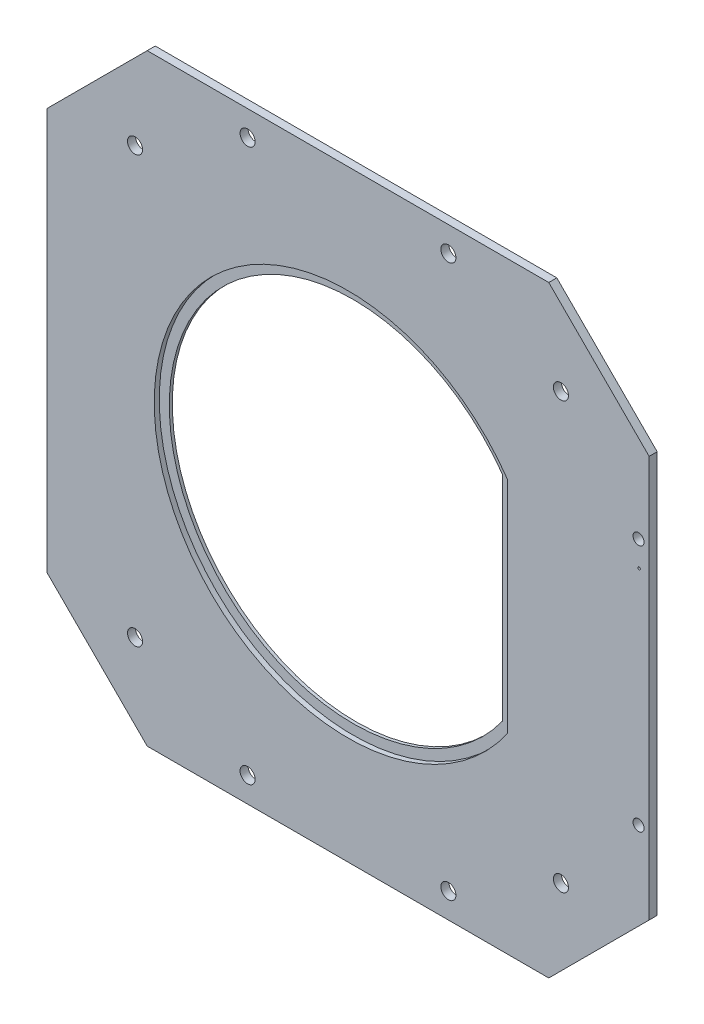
ISO-10303-21;
HEADER;
FILE_DESCRIPTION(('STEP AP214'),'2;1');
FILE_NAME('part.step','',(''),(''),'','','');
FILE_SCHEMA(('AUTOMOTIVE_DESIGN { 1 0 10303 214 1 1 1 1 }'));
ENDSEC;
DATA;
#1=APPLICATION_CONTEXT('core data for automotive mechanical design processes');
#2=APPLICATION_PROTOCOL_DEFINITION('international standard','automotive_design',2000,#1);
#3=PRODUCT_CONTEXT('',#1,'mechanical');
#4=PRODUCT('Part','Part','',(#3));
#5=PRODUCT_RELATED_PRODUCT_CATEGORY('part','',(#4));
#6=PRODUCT_DEFINITION_FORMATION('','',#4);
#7=PRODUCT_DEFINITION_CONTEXT('part definition',#1,'design');
#8=PRODUCT_DEFINITION('design','',#6,#7);
#9=PRODUCT_DEFINITION_SHAPE('','',#8);
#10=(LENGTH_UNIT() NAMED_UNIT(*) SI_UNIT(.MILLI.,.METRE.));
#11=(NAMED_UNIT(*) PLANE_ANGLE_UNIT() SI_UNIT($,.RADIAN.));
#12=(NAMED_UNIT(*) SI_UNIT($,.STERADIAN.) SOLID_ANGLE_UNIT());
#13=UNCERTAINTY_MEASURE_WITH_UNIT(LENGTH_MEASURE(1.E-05),#10,'distance_accuracy_value','');
#14=(GEOMETRIC_REPRESENTATION_CONTEXT(3) GLOBAL_UNCERTAINTY_ASSIGNED_CONTEXT((#13)) GLOBAL_UNIT_ASSIGNED_CONTEXT((#10,
#11,#12)) REPRESENTATION_CONTEXT('',''));
#15=CARTESIAN_POINT('',(0.,0.,0.));
#16=DIRECTION('',(0.,0.,1.));
#17=DIRECTION('',(1.,0.,0.));
#18=AXIS2_PLACEMENT_3D('',#15,#16,#17);
#19=CARTESIAN_POINT('',(0.,0.,0.));
#20=DIRECTION('',(0.,0.,1.));
#21=DIRECTION('',(1.,0.,0.));
#22=AXIS2_PLACEMENT_3D('',#19,#20,#21);
#23=CYLINDRICAL_SURFACE('',#22,36.6);
#24=CARTESIAN_POINT('',(0.,0.,0.6));
#25=DIRECTION('',(0.,0.,1.));
#26=DIRECTION('',(1.,0.,0.));
#27=AXIS2_PLACEMENT_3D('',#24,#25,#26);
#28=CIRCLE('',#27,36.6);
#29=CARTESIAN_POINT('',(29.75,-21.3189469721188,0.600000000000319));
#30=VERTEX_POINT('',#29);
#31=CARTESIAN_POINT('',(29.75,21.3189469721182,0.6));
#32=VERTEX_POINT('',#31);
#33=EDGE_CURVE('E59',#30,#32,#28,.F.);
#34=ORIENTED_EDGE('',*,*,#33,.F.);
#35=DIRECTION('',(0.,0.,1.));
#36=VECTOR('',#35,1.);
#37=CARTESIAN_POINT('',(29.75,-21.3189469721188,3.19189119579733E-13));
#38=LINE('',#37,#36);
#39=CARTESIAN_POINT('',(29.75,-21.3189469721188,3.19189119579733E-13));
#40=VERTEX_POINT('',#39);
#41=EDGE_CURVE('E160',#40,#30,#38,.T.);
#42=ORIENTED_EDGE('',*,*,#41,.F.);
#43=CARTESIAN_POINT('',(0.,0.,0.));
#44=DIRECTION('',(0.,0.,1.));
#45=DIRECTION('',(1.,0.,0.));
#46=AXIS2_PLACEMENT_3D('',#43,#44,#45);
#47=CIRCLE('',#46,36.6);
#48=CARTESIAN_POINT('',(29.75,21.3189469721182,0.));
#49=VERTEX_POINT('',#48);
#50=EDGE_CURVE('E154',#49,#40,#47,.T.);
#51=ORIENTED_EDGE('',*,*,#50,.F.);
#52=DIRECTION('',(0.,0.,1.));
#53=VECTOR('',#52,1.);
#54=CARTESIAN_POINT('',(29.75,21.3189469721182,0.));
#55=LINE('',#54,#53);
#56=EDGE_CURVE('E161',#49,#32,#55,.T.);
#57=ORIENTED_EDGE('',*,*,#56,.T.);
#58=EDGE_LOOP('',(#34,#42,#51,#57));
#59=FACE_BOUND('',#58,.T.);
#60=ADVANCED_FACE('F36',(#59),#23,.F.);
#61=CARTESIAN_POINT('',(29.75,21.3189469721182,0.));
#62=DIRECTION('',(1.,0.,0.));
#63=DIRECTION('',(0.,1.,0.));
#64=AXIS2_PLACEMENT_3D('',#61,#62,#63);
#65=PLANE('',#64);
#66=DIRECTION('',(0.,-1.,0.));
#67=VECTOR('',#66,1.);
#68=CARTESIAN_POINT('',(29.75,21.3189469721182,0.6));
#69=LINE('',#68,#67);
#70=EDGE_CURVE('E11',#32,#30,#69,.T.);
#71=ORIENTED_EDGE('',*,*,#70,.F.);
#72=ORIENTED_EDGE('',*,*,#56,.F.);
#73=DIRECTION('',(0.,1.,0.));
#74=VECTOR('',#73,1.);
#75=CARTESIAN_POINT('',(29.75,21.3189469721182,0.));
#76=LINE('',#75,#74);
#77=EDGE_CURVE('E157',#40,#49,#76,.T.);
#78=ORIENTED_EDGE('',*,*,#77,.F.);
#79=ORIENTED_EDGE('',*,*,#41,.T.);
#80=EDGE_LOOP('',(#71,#72,#78,#79));
#81=FACE_BOUND('',#80,.T.);
#82=ADVANCED_FACE('F333',(#81),#65,.F.);
#83=CARTESIAN_POINT('',(-59.9999999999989,40.0000000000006,1.59999999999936));
#84=DIRECTION('',(1.,0.,0.));
#85=DIRECTION('',(0.,1.,0.));
#86=AXIS2_PLACEMENT_3D('',#83,#84,#85);
#87=PLANE('',#86);
#88=DIRECTION('',(0.,-1.,0.));
#89=VECTOR('',#88,1.);
#90=CARTESIAN_POINT('',(-59.9999999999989,40.0000000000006,-5.30825383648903E-13));
#91=LINE('',#90,#89);
#92=CARTESIAN_POINT('',(-59.9999999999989,40.0000000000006,-5.30825383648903E-13));
#93=VERTEX_POINT('',#92);
#94=CARTESIAN_POINT('',(-59.9999999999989,-39.9999999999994,-3.19189119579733E-13));
#95=VERTEX_POINT('',#94);
#96=EDGE_CURVE('E164',#93,#95,#91,.T.);
#97=ORIENTED_EDGE('',*,*,#96,.T.);
#98=DIRECTION('',(0.,0.,-1.));
#99=VECTOR('',#98,1.);
#100=CARTESIAN_POINT('',(-59.9999999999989,-39.9999999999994,1.6));
#101=LINE('',#100,#99);
#102=CARTESIAN_POINT('',(-59.9999999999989,-39.9999999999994,1.6));
#103=VERTEX_POINT('',#102);
#104=EDGE_CURVE('E45',#103,#95,#101,.T.);
#105=ORIENTED_EDGE('',*,*,#104,.F.);
#106=DIRECTION('',(0.,-1.,0.));
#107=VECTOR('',#106,1.);
#108=CARTESIAN_POINT('',(-59.9999999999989,40.0000000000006,1.59999999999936));
#109=LINE('',#108,#107);
#110=CARTESIAN_POINT('',(-59.9999999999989,40.0000000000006,1.59999999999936));
#111=VERTEX_POINT('',#110);
#112=EDGE_CURVE('E183',#111,#103,#109,.T.);
#113=ORIENTED_EDGE('',*,*,#112,.F.);
#114=DIRECTION('',(0.,0.,-1.));
#115=VECTOR('',#114,1.);
#116=CARTESIAN_POINT('',(-59.9999999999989,40.0000000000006,1.59999999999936));
#117=LINE('',#116,#115);
#118=EDGE_CURVE('E200',#111,#93,#117,.T.);
#119=ORIENTED_EDGE('',*,*,#118,.T.);
#120=EDGE_LOOP('',(#97,#105,#113,#119));
#121=FACE_BOUND('',#120,.T.);
#122=ADVANCED_FACE('F38',(#121),#87,.F.);
#123=CARTESIAN_POINT('',(-59.9999999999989,-39.9999999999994,1.6));
#124=DIRECTION('',(0.707106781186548,0.707106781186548,0.));
#125=DIRECTION('',(-0.707106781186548,0.707106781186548,0.));
#126=AXIS2_PLACEMENT_3D('',#123,#124,#125);
#127=PLANE('',#126);
#128=DIRECTION('',(0.707106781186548,-0.707106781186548,0.));
#129=VECTOR('',#128,1.);
#130=CARTESIAN_POINT('',(-59.9999999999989,-39.9999999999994,-3.19189119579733E-13));
#131=LINE('',#130,#129);
#132=CARTESIAN_POINT('',(-39.9999999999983,-59.9999999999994,0.));
#133=VERTEX_POINT('',#132);
#134=EDGE_CURVE('E169',#95,#133,#131,.T.);
#135=ORIENTED_EDGE('',*,*,#134,.T.);
#136=DIRECTION('',(0.,0.,-1.));
#137=VECTOR('',#136,1.);
#138=CARTESIAN_POINT('',(-39.9999999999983,-59.9999999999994,1.59999999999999));
#139=LINE('',#138,#137);
#140=CARTESIAN_POINT('',(-39.9999999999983,-59.9999999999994,1.59999999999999));
#141=VERTEX_POINT('',#140);
#142=EDGE_CURVE('E218',#141,#133,#139,.T.);
#143=ORIENTED_EDGE('',*,*,#142,.F.);
#144=DIRECTION('',(0.707106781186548,-0.707106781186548,0.));
#145=VECTOR('',#144,1.);
#146=CARTESIAN_POINT('',(-59.9999999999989,-39.9999999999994,1.6));
#147=LINE('',#146,#145);
#148=EDGE_CURVE('E186',#103,#141,#147,.T.);
#149=ORIENTED_EDGE('',*,*,#148,.F.);
#150=ORIENTED_EDGE('',*,*,#104,.T.);
#151=EDGE_LOOP('',(#135,#143,#149,#150));
#152=FACE_BOUND('',#151,.T.);
#153=ADVANCED_FACE('F326',(#152),#127,.F.);
#154=CARTESIAN_POINT('',(-39.9999999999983,-59.9999999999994,1.59999999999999));
#155=DIRECTION('',(0.,1.,0.));
#156=DIRECTION('',(0.,0.,1.));
#157=AXIS2_PLACEMENT_3D('',#154,#155,#156);
#158=PLANE('',#157);
#159=DIRECTION('',(1.,0.,0.));
#160=VECTOR('',#159,1.);
#161=CARTESIAN_POINT('',(-39.9999999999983,-59.9999999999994,0.));
#162=LINE('',#161,#160);
#163=CARTESIAN_POINT('',(40.0000000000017,-60.,0.));
#164=VERTEX_POINT('',#163);
#165=EDGE_CURVE('E171',#133,#164,#162,.T.);
#166=ORIENTED_EDGE('',*,*,#165,.T.);
#167=DIRECTION('',(0.,0.,-1.));
#168=VECTOR('',#167,1.);
#169=CARTESIAN_POINT('',(40.0000000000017,-60.,1.60000000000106));
#170=LINE('',#169,#168);
#171=CARTESIAN_POINT('',(40.0000000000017,-60.,1.60000000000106));
#172=VERTEX_POINT('',#171);
#173=EDGE_CURVE('E215',#172,#164,#170,.T.);
#174=ORIENTED_EDGE('',*,*,#173,.F.);
#175=DIRECTION('',(1.,0.,0.));
#176=VECTOR('',#175,1.);
#177=CARTESIAN_POINT('',(-39.9999999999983,-59.9999999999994,1.59999999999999));
#178=LINE('',#177,#176);
#179=EDGE_CURVE('E188',#141,#172,#178,.T.);
#180=ORIENTED_EDGE('',*,*,#179,.F.);
#181=ORIENTED_EDGE('',*,*,#142,.T.);
#182=EDGE_LOOP('',(#166,#174,#180,#181));
#183=FACE_BOUND('',#182,.T.);
#184=ADVANCED_FACE('F322',(#183),#158,.F.);
#185=CARTESIAN_POINT('',(40.0000000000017,-60.,1.60000000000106));
#186=DIRECTION('',(-0.707106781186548,0.707106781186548,0.));
#187=DIRECTION('',(-0.707106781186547,-0.707106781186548,0.));
#188=AXIS2_PLACEMENT_3D('',#185,#186,#187);
#189=PLANE('',#188);
#190=DIRECTION('',(0.707106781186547,0.707106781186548,0.));
#191=VECTOR('',#190,1.);
#192=CARTESIAN_POINT('',(40.0000000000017,-60.,0.));
#193=LINE('',#192,#191);
#194=CARTESIAN_POINT('',(60.0000000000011,-40.,5.30825383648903E-13));
#195=VERTEX_POINT('',#194);
#196=EDGE_CURVE('E173',#164,#195,#193,.T.);
#197=ORIENTED_EDGE('',*,*,#196,.T.);
#198=DIRECTION('',(0.,0.,-1.));
#199=VECTOR('',#198,1.);
#200=CARTESIAN_POINT('',(60.0000000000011,-40.,1.60000000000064));
#201=LINE('',#200,#199);
#202=CARTESIAN_POINT('',(60.0000000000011,-40.,1.60000000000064));
#203=VERTEX_POINT('',#202);
#204=EDGE_CURVE('E212',#203,#195,#201,.T.);
#205=ORIENTED_EDGE('',*,*,#204,.F.);
#206=DIRECTION('',(0.707106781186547,0.707106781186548,0.));
#207=VECTOR('',#206,1.);
#208=CARTESIAN_POINT('',(40.0000000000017,-60.,1.60000000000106));
#209=LINE('',#208,#207);
#210=EDGE_CURVE('E190',#172,#203,#209,.T.);
#211=ORIENTED_EDGE('',*,*,#210,.F.);
#212=ORIENTED_EDGE('',*,*,#173,.T.);
#213=EDGE_LOOP('',(#197,#205,#211,#212));
#214=FACE_BOUND('',#213,.T.);
#215=ADVANCED_FACE('F319',(#214),#189,.F.);
#216=CARTESIAN_POINT('',(60.0000000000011,40.,1.6));
#217=DIRECTION('',(-1.,0.,0.));
#218=DIRECTION('',(0.,-1.,0.));
#219=AXIS2_PLACEMENT_3D('',#216,#217,#218);
#220=PLANE('',#219);
#221=DIRECTION('',(0.,1.,0.));
#222=VECTOR('',#221,1.);
#223=CARTESIAN_POINT('',(60.0000000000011,40.,3.19189119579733E-13));
#224=LINE('',#223,#222);
#225=CARTESIAN_POINT('',(60.0000000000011,40.,3.19189119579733E-13));
#226=VERTEX_POINT('',#225);
#227=EDGE_CURVE('E175',#195,#226,#224,.T.);
#228=ORIENTED_EDGE('',*,*,#227,.T.);
#229=DIRECTION('',(0.,0.,-1.));
#230=VECTOR('',#229,1.);
#231=CARTESIAN_POINT('',(60.0000000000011,40.,1.6));
#232=LINE('',#231,#230);
#233=CARTESIAN_POINT('',(60.0000000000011,40.,1.6));
#234=VERTEX_POINT('',#233);
#235=EDGE_CURVE('E209',#234,#226,#232,.T.);
#236=ORIENTED_EDGE('',*,*,#235,.F.);
#237=DIRECTION('',(0.,1.,0.));
#238=VECTOR('',#237,1.);
#239=CARTESIAN_POINT('',(60.0000000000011,40.,1.6));
#240=LINE('',#239,#238);
#241=EDGE_CURVE('E192',#203,#234,#240,.T.);
#242=ORIENTED_EDGE('',*,*,#241,.F.);
#243=ORIENTED_EDGE('',*,*,#204,.T.);
#244=EDGE_LOOP('',(#228,#236,#242,#243));
#245=FACE_BOUND('',#244,.T.);
#246=ADVANCED_FACE('F315',(#245),#220,.F.);
#247=CARTESIAN_POINT('',(40.0000000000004,60.,1.6));
#248=DIRECTION('',(-0.707106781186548,-0.707106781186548,0.));
#249=DIRECTION('',(0.707106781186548,-0.707106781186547,0.));
#250=AXIS2_PLACEMENT_3D('',#247,#248,#249);
#251=PLANE('',#250);
#252=DIRECTION('',(-0.707106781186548,0.707106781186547,0.));
#253=VECTOR('',#252,1.);
#254=CARTESIAN_POINT('',(40.0000000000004,60.,0.));
#255=LINE('',#254,#253);
#256=CARTESIAN_POINT('',(40.0000000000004,60.,0.));
#257=VERTEX_POINT('',#256);
#258=EDGE_CURVE('E177',#226,#257,#255,.T.);
#259=ORIENTED_EDGE('',*,*,#258,.T.);
#260=DIRECTION('',(0.,0.,-1.));
#261=VECTOR('',#260,1.);
#262=CARTESIAN_POINT('',(40.0000000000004,60.,1.6));
#263=LINE('',#262,#261);
#264=CARTESIAN_POINT('',(40.0000000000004,60.,1.6));
#265=VERTEX_POINT('',#264);
#266=EDGE_CURVE('E206',#265,#257,#263,.T.);
#267=ORIENTED_EDGE('',*,*,#266,.F.);
#268=DIRECTION('',(-0.707106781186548,0.707106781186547,0.));
#269=VECTOR('',#268,1.);
#270=CARTESIAN_POINT('',(40.0000000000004,60.,1.6));
#271=LINE('',#270,#269);
#272=EDGE_CURVE('E194',#234,#265,#271,.T.);
#273=ORIENTED_EDGE('',*,*,#272,.F.);
#274=ORIENTED_EDGE('',*,*,#235,.T.);
#275=EDGE_LOOP('',(#259,#267,#273,#274));
#276=FACE_BOUND('',#275,.T.);
#277=ADVANCED_FACE('F310',(#276),#251,.F.);
#278=CARTESIAN_POINT('',(-39.9999999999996,60.0000000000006,1.59999999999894));
#279=DIRECTION('',(0.,-1.,0.));
#280=DIRECTION('',(0.,0.,-1.));
#281=AXIS2_PLACEMENT_3D('',#278,#279,#280);
#282=PLANE('',#281);
#283=DIRECTION('',(-1.,0.,0.));
#284=VECTOR('',#283,1.);
#285=CARTESIAN_POINT('',(-39.9999999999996,60.0000000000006,0.));
#286=LINE('',#285,#284);
#287=CARTESIAN_POINT('',(-39.9999999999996,60.0000000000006,0.));
#288=VERTEX_POINT('',#287);
#289=EDGE_CURVE('E179',#257,#288,#286,.T.);
#290=ORIENTED_EDGE('',*,*,#289,.T.);
#291=DIRECTION('',(0.,0.,-1.));
#292=VECTOR('',#291,1.);
#293=CARTESIAN_POINT('',(-39.9999999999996,60.0000000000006,1.59999999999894));
#294=LINE('',#293,#292);
#295=CARTESIAN_POINT('',(-39.9999999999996,60.0000000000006,1.59999999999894));
#296=VERTEX_POINT('',#295);
#297=EDGE_CURVE('E203',#296,#288,#294,.T.);
#298=ORIENTED_EDGE('',*,*,#297,.F.);
#299=DIRECTION('',(-1.,0.,0.));
#300=VECTOR('',#299,1.);
#301=CARTESIAN_POINT('',(-39.9999999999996,60.0000000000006,1.59999999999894));
#302=LINE('',#301,#300);
#303=EDGE_CURVE('E196',#265,#296,#302,.T.);
#304=ORIENTED_EDGE('',*,*,#303,.F.);
#305=ORIENTED_EDGE('',*,*,#266,.T.);
#306=EDGE_LOOP('',(#290,#298,#304,#305));
#307=FACE_BOUND('',#306,.T.);
#308=ADVANCED_FACE('F304',(#307),#282,.F.);
#309=CARTESIAN_POINT('',(-59.9999999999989,40.0000000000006,1.59999999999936));
#310=DIRECTION('',(0.707106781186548,-0.707106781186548,0.));
#311=DIRECTION('',(0.707106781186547,0.707106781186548,0.));
#312=AXIS2_PLACEMENT_3D('',#309,#310,#311);
#313=PLANE('',#312);
#314=DIRECTION('',(-0.707106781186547,-0.707106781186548,0.));
#315=VECTOR('',#314,1.);
#316=CARTESIAN_POINT('',(-59.9999999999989,40.0000000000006,-5.30825383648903E-13));
#317=LINE('',#316,#315);
#318=EDGE_CURVE('E181',#288,#93,#317,.T.);
#319=ORIENTED_EDGE('',*,*,#318,.T.);
#320=ORIENTED_EDGE('',*,*,#118,.F.);
#321=DIRECTION('',(-0.707106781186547,-0.707106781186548,0.));
#322=VECTOR('',#321,1.);
#323=CARTESIAN_POINT('',(-59.9999999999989,40.0000000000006,1.59999999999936));
#324=LINE('',#323,#322);
#325=EDGE_CURVE('E198',#296,#111,#324,.T.);
#326=ORIENTED_EDGE('',*,*,#325,.F.);
#327=ORIENTED_EDGE('',*,*,#297,.T.);
#328=EDGE_LOOP('',(#319,#320,#326,#327));
#329=FACE_BOUND('',#328,.T.);
#330=ADVANCED_FACE('F272',(#329),#313,.F.);
#331=CARTESIAN_POINT('',(-59.9999999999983,-59.9999999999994,1.59999999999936));
#332=DIRECTION('',(0.,0.,1.));
#333=DIRECTION('',(1.,0.,0.));
#334=AXIS2_PLACEMENT_3D('',#331,#332,#333);
#335=PLANE('',#334);
#336=CARTESIAN_POINT('',(57.8900000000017,-24.6850000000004,1.6));
#337=DIRECTION('',(0.,0.,1.));
#338=DIRECTION('',(1.,0.,0.));
#339=AXIS2_PLACEMENT_3D('',#336,#337,#338);
#340=CIRCLE('',#339,1.09999999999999);
#341=CARTESIAN_POINT('',(58.9900000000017,-24.6850000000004,1.6));
#342=VERTEX_POINT('',#341);
#343=EDGE_CURVE('E554',#342,#342,#340,.T.);
#344=ORIENTED_EDGE('',*,*,#343,.F.);
#345=EDGE_LOOP('',(#344));
#346=FACE_BOUND('',#345,.T.);
#347=CARTESIAN_POINT('',(57.8900000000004,24.6849999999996,1.60000000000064));
#348=DIRECTION('',(0.,0.,1.));
#349=DIRECTION('',(1.,0.,0.));
#350=AXIS2_PLACEMENT_3D('',#347,#348,#349);
#351=CIRCLE('',#350,1.09999999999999);
#352=CARTESIAN_POINT('',(58.9900000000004,24.6849999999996,1.60000000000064));
#353=VERTEX_POINT('',#352);
#354=EDGE_CURVE('E556',#353,#353,#351,.T.);
#355=ORIENTED_EDGE('',*,*,#354,.F.);
#356=EDGE_LOOP('',(#355));
#357=FACE_BOUND('',#356,.T.);
#358=CARTESIAN_POINT('',(58.0000000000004,19.6849999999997,1.60000000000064));
#359=DIRECTION('',(0.,0.,1.));
#360=DIRECTION('',(1.,0.,0.));
#361=AXIS2_PLACEMENT_3D('',#358,#359,#360);
#362=CIRCLE('',#361,0.25);
#363=CARTESIAN_POINT('',(58.2500000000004,19.6849999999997,1.60000000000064));
#364=VERTEX_POINT('',#363);
#365=EDGE_CURVE('E564',#364,#364,#362,.T.);
#366=ORIENTED_EDGE('',*,*,#365,.F.);
#367=EDGE_LOOP('',(#366));
#368=FACE_BOUND('',#367,.T.);
#369=CARTESIAN_POINT('',(-42.426406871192,42.4264068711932,1.59999999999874));
#370=DIRECTION('',(0.,0.,1.));
#371=DIRECTION('',(1.,0.,0.));
#372=AXIS2_PLACEMENT_3D('',#369,#370,#371);
#373=CIRCLE('',#372,1.49999999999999);
#374=CARTESIAN_POINT('',(-40.926406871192,42.4264068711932,1.59999999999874));
#375=VERTEX_POINT('',#374);
#376=EDGE_CURVE('E254',#375,#375,#373,.T.);
#377=ORIENTED_EDGE('',*,*,#376,.F.);
#378=EDGE_LOOP('',(#377));
#379=FACE_BOUND('',#378,.T.);
#380=CARTESIAN_POINT('',(-20.0000000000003,55.0000000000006,1.6));
#381=DIRECTION('',(0.,0.,1.));
#382=DIRECTION('',(1.,0.,0.));
#383=AXIS2_PLACEMENT_3D('',#380,#381,#382);
#384=CIRCLE('',#383,1.49999999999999);
#385=CARTESIAN_POINT('',(-18.5000000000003,55.0000000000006,1.6));
#386=VERTEX_POINT('',#385);
#387=EDGE_CURVE('E244',#386,#386,#384,.T.);
#388=ORIENTED_EDGE('',*,*,#387,.F.);
#389=EDGE_LOOP('',(#388));
#390=FACE_BOUND('',#389,.T.);
#391=CARTESIAN_POINT('',(19.9999999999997,55.,1.6));
#392=DIRECTION('',(0.,0.,1.));
#393=DIRECTION('',(1.,0.,0.));
#394=AXIS2_PLACEMENT_3D('',#391,#392,#393);
#395=CIRCLE('',#394,1.49999999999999);
#396=CARTESIAN_POINT('',(21.4999999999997,55.,1.6));
#397=VERTEX_POINT('',#396);
#398=EDGE_CURVE('E241',#397,#397,#395,.T.);
#399=ORIENTED_EDGE('',*,*,#398,.F.);
#400=EDGE_LOOP('',(#399));
#401=FACE_BOUND('',#400,.T.);
#402=CARTESIAN_POINT('',(42.4264068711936,42.4264068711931,1.6));
#403=DIRECTION('',(0.,0.,1.));
#404=DIRECTION('',(1.,0.,0.));
#405=AXIS2_PLACEMENT_3D('',#402,#403,#404);
#406=CIRCLE('',#405,1.49999999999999);
#407=CARTESIAN_POINT('',(43.9264068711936,42.4264068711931,1.6));
#408=VERTEX_POINT('',#407);
#409=EDGE_CURVE('E238',#408,#408,#406,.T.);
#410=ORIENTED_EDGE('',*,*,#409,.F.);
#411=EDGE_LOOP('',(#410));
#412=FACE_BOUND('',#411,.T.);
#413=CARTESIAN_POINT('',(42.4264068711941,-42.4264068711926,1.60000000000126));
#414=DIRECTION('',(0.,0.,1.));
#415=DIRECTION('',(1.,0.,0.));
#416=AXIS2_PLACEMENT_3D('',#413,#414,#415);
#417=CIRCLE('',#416,1.49999999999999);
#418=CARTESIAN_POINT('',(43.9264068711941,-42.4264068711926,1.60000000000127));
#419=VERTEX_POINT('',#418);
#420=EDGE_CURVE('E234',#419,#419,#417,.T.);
#421=ORIENTED_EDGE('',*,*,#420,.F.);
#422=EDGE_LOOP('',(#421));
#423=FACE_BOUND('',#422,.T.);
#424=CARTESIAN_POINT('',(20.0000000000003,-55.,1.6));
#425=DIRECTION('',(0.,0.,1.));
#426=DIRECTION('',(1.,0.,0.));
#427=AXIS2_PLACEMENT_3D('',#424,#425,#426);
#428=CIRCLE('',#427,1.49999999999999);
#429=CARTESIAN_POINT('',(21.5000000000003,-55.,1.6));
#430=VERTEX_POINT('',#429);
#431=EDGE_CURVE('E230',#430,#430,#428,.T.);
#432=ORIENTED_EDGE('',*,*,#431,.F.);
#433=EDGE_LOOP('',(#432));
#434=FACE_BOUND('',#433,.T.);
#435=CARTESIAN_POINT('',(-19.9999999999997,-54.9999999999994,1.6));
#436=DIRECTION('',(0.,0.,1.));
#437=DIRECTION('',(1.,0.,0.));
#438=AXIS2_PLACEMENT_3D('',#435,#436,#437);
#439=CIRCLE('',#438,1.49999999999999);
#440=CARTESIAN_POINT('',(-18.4999999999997,-54.9999999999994,1.6));
#441=VERTEX_POINT('',#440);
#442=EDGE_CURVE('E226',#441,#441,#439,.T.);
#443=ORIENTED_EDGE('',*,*,#442,.F.);
#444=EDGE_LOOP('',(#443));
#445=FACE_BOUND('',#444,.T.);
#446=CARTESIAN_POINT('',(-42.4264068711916,-42.4264068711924,1.6));
#447=DIRECTION('',(0.,0.,1.));
#448=DIRECTION('',(1.,0.,0.));
#449=AXIS2_PLACEMENT_3D('',#446,#447,#448);
#450=CIRCLE('',#449,1.49999999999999);
#451=CARTESIAN_POINT('',(-40.9264068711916,-42.4264068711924,1.6));
#452=VERTEX_POINT('',#451);
#453=EDGE_CURVE('E144',#452,#452,#450,.T.);
#454=ORIENTED_EDGE('',*,*,#453,.F.);
#455=EDGE_LOOP('',(#454));
#456=FACE_BOUND('',#455,.T.);
#457=CARTESIAN_POINT('',(0.,0.,1.6));
#458=DIRECTION('',(0.,0.,1.));
#459=DIRECTION('',(1.,0.,0.));
#460=AXIS2_PLACEMENT_3D('',#457,#458,#459);
#461=CIRCLE('',#460,38.6);
#462=CARTESIAN_POINT('',(31.7500000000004,21.952163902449,1.60000000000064));
#463=VERTEX_POINT('',#462);
#464=CARTESIAN_POINT('',(31.7500000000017,-21.9521639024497,1.6));
#465=VERTEX_POINT('',#464);
#466=EDGE_CURVE('E53',#463,#465,#461,.T.);
#467=ORIENTED_EDGE('',*,*,#466,.F.);
#468=DIRECTION('',(0.,1.,0.));
#469=VECTOR('',#468,1.);
#470=CARTESIAN_POINT('',(31.7500000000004,21.952163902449,1.60000000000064));
#471=LINE('',#470,#469);
#472=EDGE_CURVE('E135',#465,#463,#471,.T.);
#473=ORIENTED_EDGE('',*,*,#472,.F.);
#474=EDGE_LOOP('',(#467,#473));
#475=FACE_BOUND('',#474,.T.);
#476=ORIENTED_EDGE('',*,*,#112,.T.);
#477=ORIENTED_EDGE('',*,*,#148,.T.);
#478=ORIENTED_EDGE('',*,*,#179,.T.);
#479=ORIENTED_EDGE('',*,*,#210,.T.);
#480=ORIENTED_EDGE('',*,*,#241,.T.);
#481=ORIENTED_EDGE('',*,*,#272,.T.);
#482=ORIENTED_EDGE('',*,*,#303,.T.);
#483=ORIENTED_EDGE('',*,*,#325,.T.);
#484=EDGE_LOOP('',(#476,#477,#478,#479,#480,#481,#482,#483));
#485=FACE_BOUND('',#484,.T.);
#486=ADVANCED_FACE('F139',(#346,#357,#368,#379,#390,#401,#412,#423,#434,#445,#456,#475,#485),
#335,.T.);
#487=CARTESIAN_POINT('',(-59.9999999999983,-59.9999999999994,0.));
#488=DIRECTION('',(0.,0.,1.));
#489=DIRECTION('',(1.,0.,0.));
#490=AXIS2_PLACEMENT_3D('',#487,#488,#489);
#491=PLANE('',#490);
#492=CARTESIAN_POINT('',(57.8900000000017,-24.6850000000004,6.34908792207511E-13));
#493=DIRECTION('',(0.,0.,1.));
#494=DIRECTION('',(1.,0.,0.));
#495=AXIS2_PLACEMENT_3D('',#492,#493,#494);
#496=CIRCLE('',#495,1.1);
#497=CARTESIAN_POINT('',(58.9900000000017,-24.6850000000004,6.3621728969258E-13));
#498=VERTEX_POINT('',#497);
#499=EDGE_CURVE('E551',#498,#498,#496,.T.);
#500=ORIENTED_EDGE('',*,*,#499,.T.);
#501=EDGE_LOOP('',(#500));
#502=FACE_BOUND('',#501,.T.);
#503=CARTESIAN_POINT('',(57.8900000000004,24.6849999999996,1.04083408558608E-13));
#504=DIRECTION('',(0.,0.,1.));
#505=DIRECTION('',(1.,0.,0.));
#506=AXIS2_PLACEMENT_3D('',#503,#504,#505);
#507=CIRCLE('',#506,1.1);
#508=CARTESIAN_POINT('',(58.9900000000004,24.6849999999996,1.05391906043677E-13));
#509=VERTEX_POINT('',#508);
#510=EDGE_CURVE('E561',#509,#509,#507,.T.);
#511=ORIENTED_EDGE('',*,*,#510,.T.);
#512=EDGE_LOOP('',(#511));
#513=FACE_BOUND('',#512,.T.);
#514=CARTESIAN_POINT('',(58.0000000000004,19.6849999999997,0.));
#515=DIRECTION('',(0.,0.,1.));
#516=DIRECTION('',(1.,0.,0.));
#517=AXIS2_PLACEMENT_3D('',#514,#515,#516);
#518=CIRCLE('',#517,0.25);
#519=CARTESIAN_POINT('',(58.2500000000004,19.6849999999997,0.));
#520=VERTEX_POINT('',#519);
#521=EDGE_CURVE('E566',#520,#520,#518,.T.);
#522=ORIENTED_EDGE('',*,*,#521,.T.);
#523=EDGE_LOOP('',(#522));
#524=FACE_BOUND('',#523,.T.);
#525=CARTESIAN_POINT('',(-42.426406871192,42.4264068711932,0.));
#526=DIRECTION('',(0.,0.,1.));
#527=DIRECTION('',(1.,0.,0.));
#528=AXIS2_PLACEMENT_3D('',#525,#526,#527);
#529=CIRCLE('',#528,1.49999999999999);
#530=CARTESIAN_POINT('',(-40.926406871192,42.4264068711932,0.));
#531=VERTEX_POINT('',#530);
#532=EDGE_CURVE('E40',#531,#531,#529,.T.);
#533=ORIENTED_EDGE('',*,*,#532,.T.);
#534=EDGE_LOOP('',(#533));
#535=FACE_BOUND('',#534,.T.);
#536=CARTESIAN_POINT('',(-20.0000000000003,55.0000000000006,-5.30825383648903E-13));
#537=DIRECTION('',(0.,0.,1.));
#538=DIRECTION('',(1.,0.,0.));
#539=AXIS2_PLACEMENT_3D('',#536,#537,#538);
#540=CIRCLE('',#539,1.49999999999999);
#541=CARTESIAN_POINT('',(-18.5000000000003,55.0000000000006,-5.29041068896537E-13));
#542=VERTEX_POINT('',#541);
#543=EDGE_CURVE('E242',#542,#542,#540,.T.);
#544=ORIENTED_EDGE('',*,*,#543,.T.);
#545=EDGE_LOOP('',(#544));
#546=FACE_BOUND('',#545,.T.);
#547=CARTESIAN_POINT('',(19.9999999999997,55.,0.));
#548=DIRECTION('',(0.,0.,1.));
#549=DIRECTION('',(1.,0.,0.));
#550=AXIS2_PLACEMENT_3D('',#547,#548,#549);
#551=CIRCLE('',#550,1.49999999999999);
#552=CARTESIAN_POINT('',(21.4999999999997,55.,0.));
#553=VERTEX_POINT('',#552);
#554=EDGE_CURVE('E239',#553,#553,#551,.T.);
#555=ORIENTED_EDGE('',*,*,#554,.T.);
#556=EDGE_LOOP('',(#555));
#557=FACE_BOUND('',#556,.T.);
#558=CARTESIAN_POINT('',(42.4264068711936,42.4264068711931,-3.19189119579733E-13));
#559=DIRECTION('',(0.,0.,1.));
#560=DIRECTION('',(1.,0.,0.));
#561=AXIS2_PLACEMENT_3D('',#558,#559,#560);
#562=CIRCLE('',#561,1.49999999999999);
#563=CARTESIAN_POINT('',(43.9264068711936,42.4264068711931,-3.17404804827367E-13));
#564=VERTEX_POINT('',#563);
#565=EDGE_CURVE('E235',#564,#564,#562,.T.);
#566=ORIENTED_EDGE('',*,*,#565,.T.);
#567=EDGE_LOOP('',(#566));
#568=FACE_BOUND('',#567,.T.);
#569=CARTESIAN_POINT('',(42.4264068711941,-42.4264068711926,0.));
#570=DIRECTION('',(0.,0.,1.));
#571=DIRECTION('',(1.,0.,0.));
#572=AXIS2_PLACEMENT_3D('',#569,#570,#571);
#573=CIRCLE('',#572,1.49999999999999);
#574=CARTESIAN_POINT('',(43.9264068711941,-42.4264068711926,0.));
#575=VERTEX_POINT('',#574);
#576=EDGE_CURVE('E231',#575,#575,#573,.T.);
#577=ORIENTED_EDGE('',*,*,#576,.T.);
#578=EDGE_LOOP('',(#577));
#579=FACE_BOUND('',#578,.T.);
#580=CARTESIAN_POINT('',(20.0000000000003,-55.,5.30825383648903E-13));
#581=DIRECTION('',(0.,0.,1.));
#582=DIRECTION('',(1.,0.,0.));
#583=AXIS2_PLACEMENT_3D('',#580,#581,#582);
#584=CIRCLE('',#583,1.49999999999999);
#585=CARTESIAN_POINT('',(21.5000000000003,-55.,5.32609698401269E-13));
#586=VERTEX_POINT('',#585);
#587=EDGE_CURVE('E227',#586,#586,#584,.T.);
#588=ORIENTED_EDGE('',*,*,#587,.T.);
#589=EDGE_LOOP('',(#588));
#590=FACE_BOUND('',#589,.T.);
#591=CARTESIAN_POINT('',(-19.9999999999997,-54.9999999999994,0.));
#592=DIRECTION('',(0.,0.,1.));
#593=DIRECTION('',(1.,0.,0.));
#594=AXIS2_PLACEMENT_3D('',#591,#592,#593);
#595=CIRCLE('',#594,1.49999999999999);
#596=CARTESIAN_POINT('',(-18.4999999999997,-54.9999999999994,0.));
#597=VERTEX_POINT('',#596);
#598=EDGE_CURVE('E223',#597,#597,#595,.T.);
#599=ORIENTED_EDGE('',*,*,#598,.T.);
#600=EDGE_LOOP('',(#599));
#601=FACE_BOUND('',#600,.T.);
#602=CARTESIAN_POINT('',(-42.4264068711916,-42.4264068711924,3.19189119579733E-13));
#603=DIRECTION('',(0.,0.,1.));
#604=DIRECTION('',(1.,0.,0.));
#605=AXIS2_PLACEMENT_3D('',#602,#603,#604);
#606=CIRCLE('',#605,1.49999999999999);
#607=CARTESIAN_POINT('',(-40.9264068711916,-42.4264068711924,3.20973434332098E-13));
#608=VERTEX_POINT('',#607);
#609=EDGE_CURVE('E141',#608,#608,#606,.T.);
#610=ORIENTED_EDGE('',*,*,#609,.T.);
#611=EDGE_LOOP('',(#610));
#612=FACE_BOUND('',#611,.T.);
#613=ORIENTED_EDGE('',*,*,#77,.T.);
#614=ORIENTED_EDGE('',*,*,#50,.T.);
#615=EDGE_LOOP('',(#613,#614));
#616=FACE_BOUND('',#615,.T.);
#617=ORIENTED_EDGE('',*,*,#96,.F.);
#618=ORIENTED_EDGE('',*,*,#318,.F.);
#619=ORIENTED_EDGE('',*,*,#289,.F.);
#620=ORIENTED_EDGE('',*,*,#258,.F.);
#621=ORIENTED_EDGE('',*,*,#227,.F.);
#622=ORIENTED_EDGE('',*,*,#196,.F.);
#623=ORIENTED_EDGE('',*,*,#165,.F.);
#624=ORIENTED_EDGE('',*,*,#134,.F.);
#625=EDGE_LOOP('',(#617,#618,#619,#620,#621,#622,#623,#624));
#626=FACE_BOUND('',#625,.T.);
#627=ADVANCED_FACE('F271',(#502,#513,#524,#535,#546,#557,#568,#579,#590,#601,#612,#616,#626),
#491,.F.);
#628=CARTESIAN_POINT('',(0.,0.,0.6));
#629=DIRECTION('',(0.,0.,1.));
#630=DIRECTION('',(1.,0.,0.));
#631=AXIS2_PLACEMENT_3D('',#628,#629,#630);
#632=PLANE('',#631);
#633=CARTESIAN_POINT('',(0.,0.,0.6));
#634=DIRECTION('',(0.,0.,1.));
#635=DIRECTION('',(1.,0.,0.));
#636=AXIS2_PLACEMENT_3D('',#633,#634,#635);
#637=CIRCLE('',#636,38.6);
#638=CARTESIAN_POINT('',(31.7500000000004,21.952163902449,0.599999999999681));
#639=VERTEX_POINT('',#638);
#640=CARTESIAN_POINT('',(31.7500000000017,-21.9521639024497,0.6));
#641=VERTEX_POINT('',#640);
#642=EDGE_CURVE('E128',#639,#641,#637,.T.);
#643=ORIENTED_EDGE('',*,*,#642,.T.);
#644=DIRECTION('',(0.,1.,0.));
#645=VECTOR('',#644,1.);
#646=CARTESIAN_POINT('',(31.7500000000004,21.952163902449,0.599999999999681));
#647=LINE('',#646,#645);
#648=EDGE_CURVE('E150',#641,#639,#647,.T.);
#649=ORIENTED_EDGE('',*,*,#648,.T.);
#650=EDGE_LOOP('',(#643,#649));
#651=FACE_BOUND('',#650,.T.);
#652=ORIENTED_EDGE('',*,*,#33,.T.);
#653=ORIENTED_EDGE('',*,*,#70,.T.);
#654=EDGE_LOOP('',(#652,#653));
#655=FACE_BOUND('',#654,.T.);
#656=ADVANCED_FACE('F286',(#651,#655),#632,.T.);
#657=CARTESIAN_POINT('',(0.,0.,0.6));
#658=DIRECTION('',(0.,0.,1.));
#659=DIRECTION('',(1.,0.,0.));
#660=AXIS2_PLACEMENT_3D('',#657,#658,#659);
#661=CYLINDRICAL_SURFACE('',#660,38.6);
#662=ORIENTED_EDGE('',*,*,#466,.T.);
#663=DIRECTION('',(0.,0.,1.));
#664=VECTOR('',#663,1.);
#665=CARTESIAN_POINT('',(31.7500000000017,-21.9521639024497,0.6));
#666=LINE('',#665,#664);
#667=EDGE_CURVE('E132',#641,#465,#666,.T.);
#668=ORIENTED_EDGE('',*,*,#667,.F.);
#669=ORIENTED_EDGE('',*,*,#642,.F.);
#670=DIRECTION('',(0.,0.,1.));
#671=VECTOR('',#670,1.);
#672=CARTESIAN_POINT('',(31.7500000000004,21.952163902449,0.599999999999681));
#673=LINE('',#672,#671);
#674=EDGE_CURVE('E124',#639,#463,#673,.T.);
#675=ORIENTED_EDGE('',*,*,#674,.T.);
#676=EDGE_LOOP('',(#662,#668,#669,#675));
#677=FACE_BOUND('',#676,.T.);
#678=ADVANCED_FACE('F126',(#677),#661,.F.);
#679=CARTESIAN_POINT('',(31.7500000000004,21.952163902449,0.599999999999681));
#680=DIRECTION('',(1.,0.,0.));
#681=DIRECTION('',(0.,0.,-1.));
#682=AXIS2_PLACEMENT_3D('',#679,#680,#681);
#683=PLANE('',#682);
#684=ORIENTED_EDGE('',*,*,#472,.T.);
#685=ORIENTED_EDGE('',*,*,#674,.F.);
#686=ORIENTED_EDGE('',*,*,#648,.F.);
#687=ORIENTED_EDGE('',*,*,#667,.T.);
#688=EDGE_LOOP('',(#684,#685,#686,#687));
#689=FACE_BOUND('',#688,.T.);
#690=ADVANCED_FACE('F136',(#689),#683,.F.);
#691=CARTESIAN_POINT('',(-42.4264068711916,-42.4264068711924,1.6));
#692=DIRECTION('',(0.,0.,1.));
#693=DIRECTION('',(1.,0.,0.));
#694=AXIS2_PLACEMENT_3D('',#691,#692,#693);
#695=CYLINDRICAL_SURFACE('',#694,1.49999999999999);
#696=ORIENTED_EDGE('',*,*,#453,.T.);
#697=EDGE_LOOP('',(#696));
#698=FACE_BOUND('',#697,.T.);
#699=ORIENTED_EDGE('',*,*,#609,.F.);
#700=EDGE_LOOP('',(#699));
#701=FACE_BOUND('',#700,.T.);
#702=ADVANCED_FACE('F278',(#698,#701),#695,.F.);
#703=CARTESIAN_POINT('',(-19.9999999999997,-54.9999999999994,1.6));
#704=DIRECTION('',(0.,0.,1.));
#705=DIRECTION('',(1.,0.,0.));
#706=AXIS2_PLACEMENT_3D('',#703,#704,#705);
#707=CYLINDRICAL_SURFACE('',#706,1.49999999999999);
#708=ORIENTED_EDGE('',*,*,#442,.T.);
#709=EDGE_LOOP('',(#708));
#710=FACE_BOUND('',#709,.T.);
#711=ORIENTED_EDGE('',*,*,#598,.F.);
#712=EDGE_LOOP('',(#711));
#713=FACE_BOUND('',#712,.T.);
#714=ADVANCED_FACE('F266',(#710,#713),#707,.F.);
#715=CARTESIAN_POINT('',(20.0000000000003,-55.,1.6));
#716=DIRECTION('',(0.,0.,1.));
#717=DIRECTION('',(1.,0.,0.));
#718=AXIS2_PLACEMENT_3D('',#715,#716,#717);
#719=CYLINDRICAL_SURFACE('',#718,1.49999999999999);
#720=ORIENTED_EDGE('',*,*,#431,.T.);
#721=EDGE_LOOP('',(#720));
#722=FACE_BOUND('',#721,.T.);
#723=ORIENTED_EDGE('',*,*,#587,.F.);
#724=EDGE_LOOP('',(#723));
#725=FACE_BOUND('',#724,.T.);
#726=ADVANCED_FACE('F409',(#722,#725),#719,.F.);
#727=CARTESIAN_POINT('',(42.4264068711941,-42.4264068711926,1.60000000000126));
#728=DIRECTION('',(0.,0.,1.));
#729=DIRECTION('',(1.,0.,0.));
#730=AXIS2_PLACEMENT_3D('',#727,#728,#729);
#731=CYLINDRICAL_SURFACE('',#730,1.49999999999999);
#732=ORIENTED_EDGE('',*,*,#420,.T.);
#733=EDGE_LOOP('',(#732));
#734=FACE_BOUND('',#733,.T.);
#735=ORIENTED_EDGE('',*,*,#576,.F.);
#736=EDGE_LOOP('',(#735));
#737=FACE_BOUND('',#736,.T.);
#738=ADVANCED_FACE('F416',(#734,#737),#731,.F.);
#739=CARTESIAN_POINT('',(42.4264068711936,42.4264068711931,1.6));
#740=DIRECTION('',(0.,0.,1.));
#741=DIRECTION('',(1.,0.,0.));
#742=AXIS2_PLACEMENT_3D('',#739,#740,#741);
#743=CYLINDRICAL_SURFACE('',#742,1.49999999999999);
#744=ORIENTED_EDGE('',*,*,#409,.T.);
#745=EDGE_LOOP('',(#744));
#746=FACE_BOUND('',#745,.T.);
#747=ORIENTED_EDGE('',*,*,#565,.F.);
#748=EDGE_LOOP('',(#747));
#749=FACE_BOUND('',#748,.T.);
#750=ADVANCED_FACE('F424',(#746,#749),#743,.F.);
#751=CARTESIAN_POINT('',(19.9999999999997,55.,1.6));
#752=DIRECTION('',(0.,0.,1.));
#753=DIRECTION('',(1.,0.,0.));
#754=AXIS2_PLACEMENT_3D('',#751,#752,#753);
#755=CYLINDRICAL_SURFACE('',#754,1.49999999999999);
#756=ORIENTED_EDGE('',*,*,#398,.T.);
#757=EDGE_LOOP('',(#756));
#758=FACE_BOUND('',#757,.T.);
#759=ORIENTED_EDGE('',*,*,#554,.F.);
#760=EDGE_LOOP('',(#759));
#761=FACE_BOUND('',#760,.T.);
#762=ADVANCED_FACE('F432',(#758,#761),#755,.F.);
#763=CARTESIAN_POINT('',(-20.0000000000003,55.0000000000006,1.6));
#764=DIRECTION('',(0.,0.,1.));
#765=DIRECTION('',(1.,0.,0.));
#766=AXIS2_PLACEMENT_3D('',#763,#764,#765);
#767=CYLINDRICAL_SURFACE('',#766,1.49999999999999);
#768=ORIENTED_EDGE('',*,*,#387,.T.);
#769=EDGE_LOOP('',(#768));
#770=FACE_BOUND('',#769,.T.);
#771=ORIENTED_EDGE('',*,*,#543,.F.);
#772=EDGE_LOOP('',(#771));
#773=FACE_BOUND('',#772,.T.);
#774=ADVANCED_FACE('F440',(#770,#773),#767,.F.);
#775=CARTESIAN_POINT('',(-42.426406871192,42.4264068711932,1.59999999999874));
#776=DIRECTION('',(0.,0.,1.));
#777=DIRECTION('',(1.,0.,0.));
#778=AXIS2_PLACEMENT_3D('',#775,#776,#777);
#779=CYLINDRICAL_SURFACE('',#778,1.49999999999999);
#780=ORIENTED_EDGE('',*,*,#376,.T.);
#781=EDGE_LOOP('',(#780));
#782=FACE_BOUND('',#781,.T.);
#783=ORIENTED_EDGE('',*,*,#532,.F.);
#784=EDGE_LOOP('',(#783));
#785=FACE_BOUND('',#784,.T.);
#786=ADVANCED_FACE('F448',(#782,#785),#779,.F.);
#787=CARTESIAN_POINT('',(58.0000000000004,19.6849999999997,0.));
#788=DIRECTION('',(0.,0.,1.));
#789=DIRECTION('',(1.,0.,0.));
#790=AXIS2_PLACEMENT_3D('',#787,#788,#789);
#791=CYLINDRICAL_SURFACE('',#790,0.25);
#792=ORIENTED_EDGE('',*,*,#521,.F.);
#793=EDGE_LOOP('',(#792));
#794=FACE_BOUND('',#793,.T.);
#795=ORIENTED_EDGE('',*,*,#365,.T.);
#796=EDGE_LOOP('',(#795));
#797=FACE_BOUND('',#796,.T.);
#798=ADVANCED_FACE('F455',(#794,#797),#791,.F.);
#799=CARTESIAN_POINT('',(57.8900000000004,24.6849999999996,1.60000000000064));
#800=DIRECTION('',(0.,0.,1.));
#801=DIRECTION('',(1.,0.,0.));
#802=AXIS2_PLACEMENT_3D('',#799,#800,#801);
#803=CYLINDRICAL_SURFACE('',#802,1.09999999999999);
#804=ORIENTED_EDGE('',*,*,#510,.F.);
#805=EDGE_LOOP('',(#804));
#806=FACE_BOUND('',#805,.T.);
#807=ORIENTED_EDGE('',*,*,#354,.T.);
#808=EDGE_LOOP('',(#807));
#809=FACE_BOUND('',#808,.T.);
#810=ADVANCED_FACE('F463',(#806,#809),#803,.F.);
#811=CARTESIAN_POINT('',(57.8900000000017,-24.6850000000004,1.6));
#812=DIRECTION('',(0.,0.,1.));
#813=DIRECTION('',(1.,0.,0.));
#814=AXIS2_PLACEMENT_3D('',#811,#812,#813);
#815=CYLINDRICAL_SURFACE('',#814,1.09999999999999);
#816=ORIENTED_EDGE('',*,*,#499,.F.);
#817=EDGE_LOOP('',(#816));
#818=FACE_BOUND('',#817,.T.);
#819=ORIENTED_EDGE('',*,*,#343,.T.);
#820=EDGE_LOOP('',(#819));
#821=FACE_BOUND('',#820,.T.);
#822=ADVANCED_FACE('F471',(#818,#821),#815,.F.);
#823=CLOSED_SHELL('',(#60,#82,#122,#153,#184,#215,#246,#277,#308,#330,#486,#627,#656,#678,#690,
#702,#714,#726,#738,#750,#762,#774,#786,#798,#810,#822));
#824=MANIFOLD_SOLID_BREP('B2',#823);
#825=ADVANCED_BREP_SHAPE_REPRESENTATION('',(#18,#824),#14);
#826=SHAPE_DEFINITION_REPRESENTATION(#9,#825);
ENDSEC;
END-ISO-10303-21;
